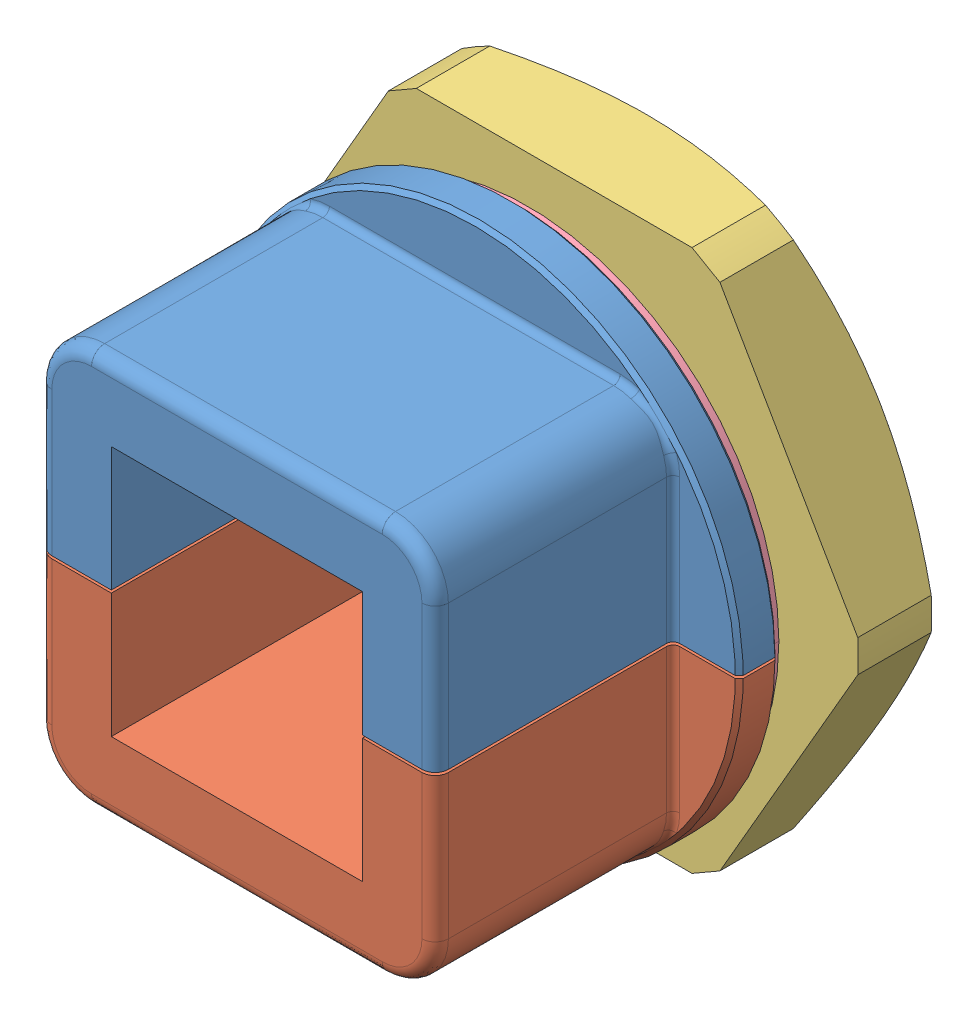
SolidWorks assembly 45026.SLDASM, configuration Default (file format 8000). Lengths in mm.
Overall size (53.32 53.79 35).
4 component instances, 4 part files, 0 mates.
Components (placement in the parent):
- 45026_01-1: 45026_01.SLDPRT [Default] at origin size (40 19.9 35)
- 45026_02-1: 45026_02.SLDPRT [Default] at origin size (40 19.9 35)
- 45026_03-1: 45026_03.SLDPRT [Default] at origin size (53.32 53.79 7)
- 45026_04-1: 45026_04.SLDPRT [Default] at origin size (38 38 1)
